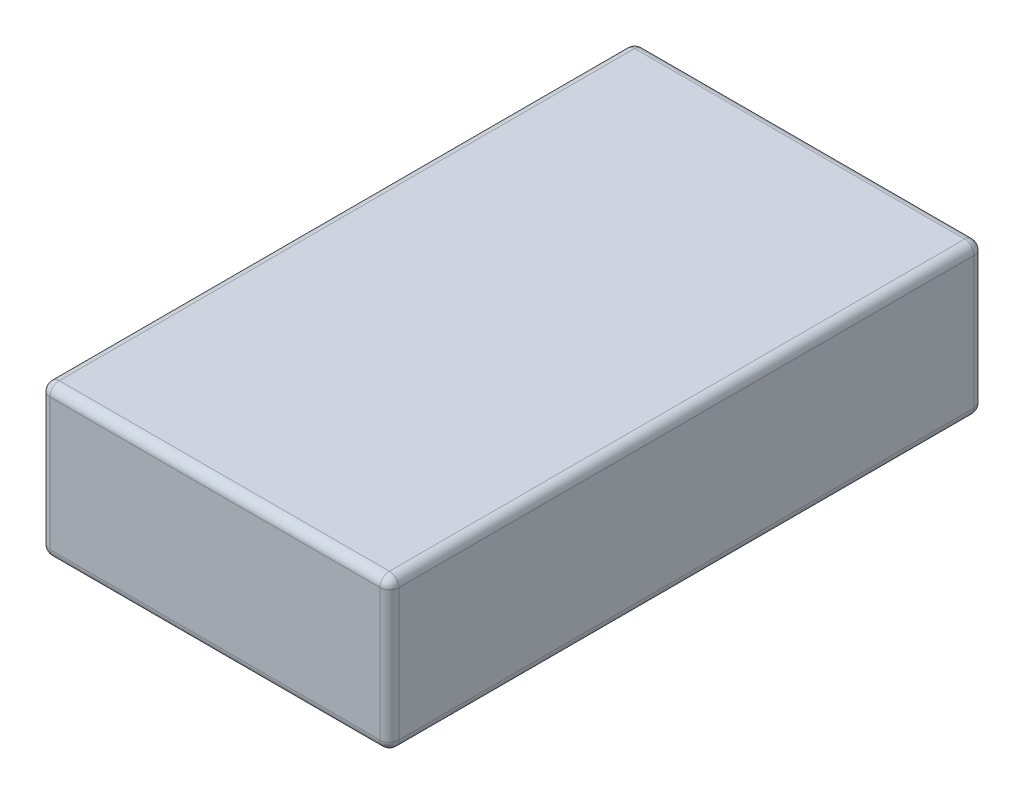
from build123d import *

# Parameters (mm, degrees)
ESQUISSE1_W             = 37
ESQUISSE1_H             = 63
EXTRUSION1_DEPTH        = 16
ESQUISSE2_W             = 8
ESQUISSE2_H             = 4
ENL_V_MAT_EXTRU_1_DEPTH = 2.5
ESQUISSE3_W             = 3
ESQUISSE3_H             = 3
EXTRUSION2_DEPTH        = 4.5
CONG_1_R                = 1


with BuildPart() as part:
    # Esquisse1 → Extrusion1 (new body)
    with BuildSketch(Plane(origin=(0, 0, 0), x_dir=(1, 0, 0), z_dir=(0, 1, 0))):
        with Locations((18.5, 31.5)):
            Rectangle(ESQUISSE1_W, ESQUISSE1_H)
    extrude(amount=EXTRUSION1_DEPTH)

    # Esquisse2 → Enl_v. mat.-Extru.1 (cut)
    with BuildSketch(Plane.XZ):
        with Locations((24, -5)):
            Rectangle(ESQUISSE2_W, ESQUISSE2_H)
    extrude(amount=-ENL_V_MAT_EXTRU_1_DEPTH, mode=Mode.SUBTRACT)

    # Esquisse3 → Extrusion2 (add)
    with BuildSketch(Plane.XZ.offset(-2.5)):
        with Locations((21.7, -5)):
            Rectangle(ESQUISSE3_W, ESQUISSE3_H)
    extrude(amount=EXTRUSION2_DEPTH)

    # Cong_1
    cong_1_edges = [part.edges().sort_by_distance(p)[0] for p in [
        (37, 16, -31.5),
        (18.5, 16, -63),
        (0, 16, -31.5),
        (18.5, 0, -63),
        (37, 0, -31.5),
        (18.5, 0, 0),
        (0, 0, -31.5),
        (18.5, 16, 0),
        (0, 8, -63),
        (37, 8, -63),
        (37, 8, 0),
        (0, 8, 0),
    ]]
    fillet(cong_1_edges, radius=CONG_1_R)


solid = part.part
